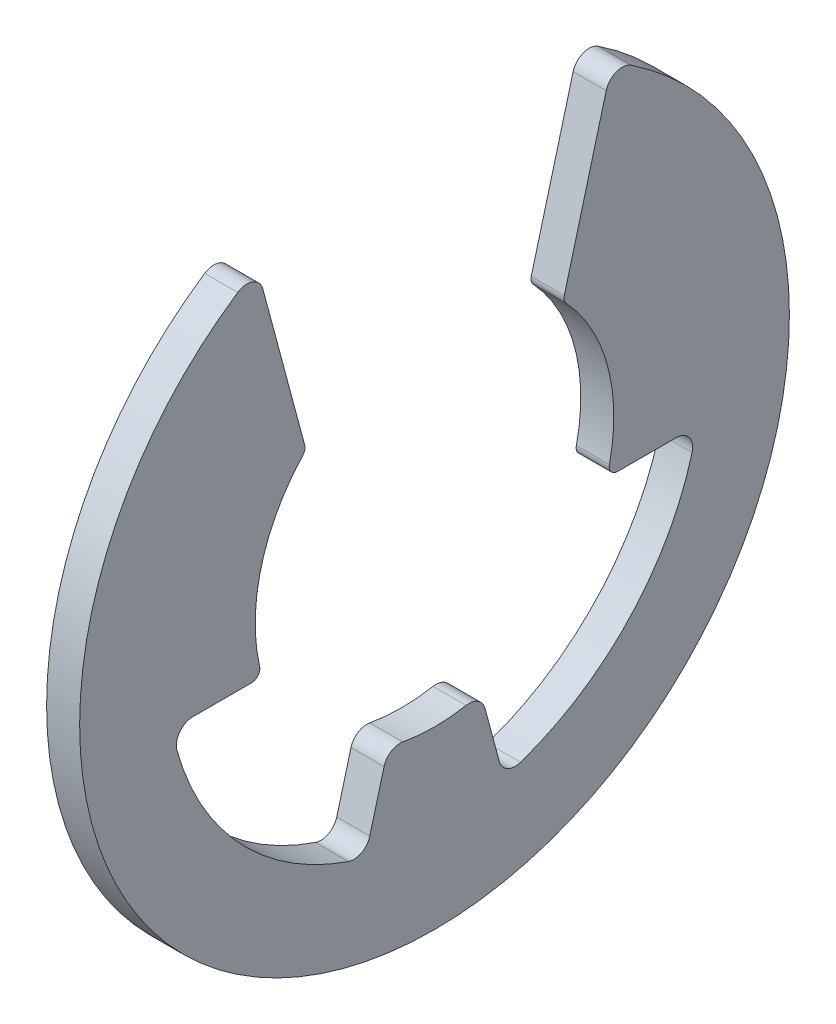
from build123d import *

# Parameters (mm, degrees)
LINEAR_AUSTRAGEN1_DEPTH = 1.75


with BuildPart() as part:
    # Skizze1 → Linear austragen1 (new body)
    with BuildSketch(Plane(origin=(0, 0, 0), x_dir=(0, 0, -1), z_dir=(1, 0, 0))):
        with BuildLine():
            Line((9.094964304, 15.142868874), (6.875141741, 6.858378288))
            ThreePointArc((6.875141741, 6.858378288), (6.872996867, 6.640243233), (6.976450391, 6.448188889))
            ThreePointArc((6.976450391, 6.448188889), (9.176536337, 2.457881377), (9.265466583, -2.097886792))
            ThreePointArc((9.265466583, -2.097886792), (9.350351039, -2.467573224), (9.692165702, -2.632))
            Line((9.692165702, -2.632), (12.803381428, -2.632))
            ThreePointArc((12.803381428, -2.632), (13.499042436, -2.976263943), (13.64729544, -3.738158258))
            ThreePointArc((13.64729544, -3.738158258), (10.303150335, -9.69884494), (4.555219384, -13.396733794))
            ThreePointArc((4.555219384, -13.396733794), (3.861261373, -13.340100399), (3.428351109, -12.794780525))
            Line((3.428351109, -12.794780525), (2.675680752, -9.98577651))
            ThreePointArc((2.675680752, -9.98577651), (2.299588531, -9.473611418), (1.676116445, -9.350969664))
            ThreePointArc((1.676116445, -9.350969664), (5.5e-08, -9.5), (-1.676116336, -9.350969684))
            ThreePointArc((-1.676116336, -9.350969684), (-2.299588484, -9.473611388), (-2.675680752, -9.98577651))
            Line((-2.675680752, -9.98577651), (-3.428351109, -12.794780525))
            ThreePointArc((-3.428351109, -12.794780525), (-3.861261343, -13.340100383), (-4.55521932, -13.396733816))
            ThreePointArc((-4.55521932, -13.396733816), (-10.303150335, -9.69884494), (-13.647295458, -3.738158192))
            ThreePointArc((-13.647295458, -3.738158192), (-13.499042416, -2.976263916), (-12.803381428, -2.632))
            Line((-12.803381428, -2.632), (-9.692165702, -2.632))
            ThreePointArc((-9.692165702, -2.632), (-9.350351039, -2.467573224), (-9.265466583, -2.097886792))
            ThreePointArc((-9.265466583, -2.097886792), (-9.176536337, 2.457881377), (-6.976450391, 6.448188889))
            ThreePointArc((-6.976450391, 6.448188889), (-6.872996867, 6.640243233), (-6.875141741, 6.858378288))
            Line((-6.875141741, 6.858378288), (-9.094964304, 15.142868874))
            ThreePointArc((-9.094964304, 15.142868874), (-9.631424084, 15.735129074), (-10.425372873, 15.644538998))
            ThreePointArc((-10.425372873, 15.644538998), (0, -18.8), (10.425372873, 15.644538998))
            ThreePointArc((10.425372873, 15.644538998), (9.631424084, 15.735129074), (9.094964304, 15.142868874))
        make_face()
    extrude(amount=LINEAR_AUSTRAGEN1_DEPTH)


solid = part.part
